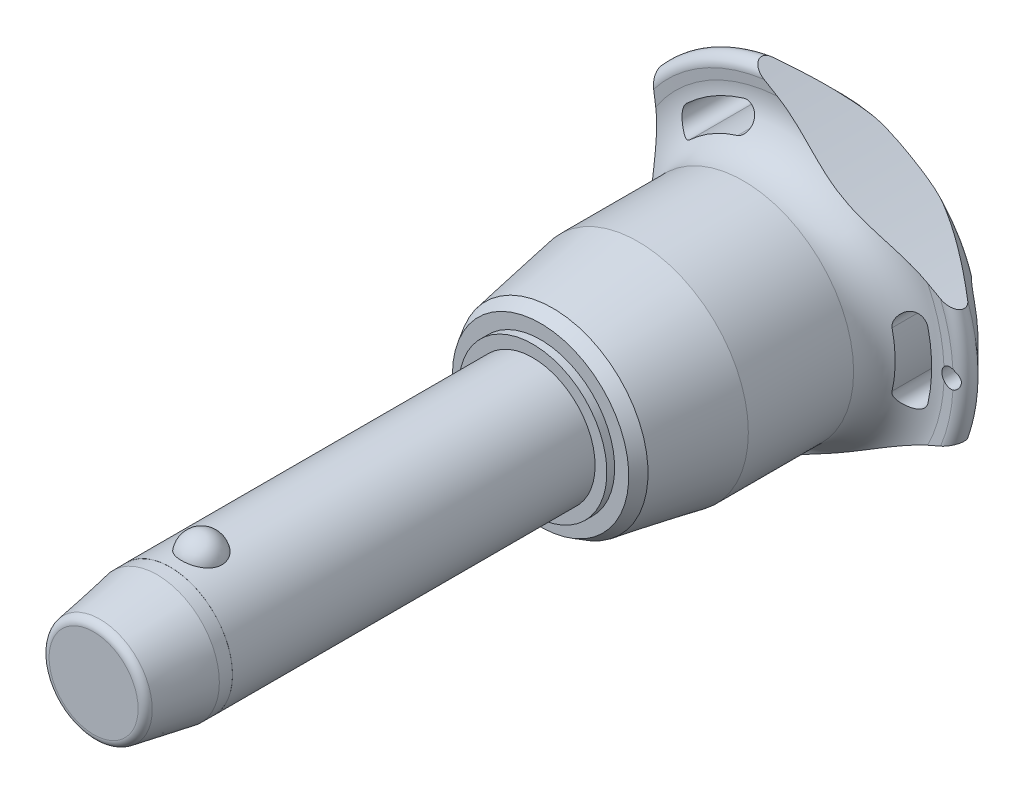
from build123d import *

# Parameters (mm, degrees)
SKETCH1_R           = 10
BOSS_EXTRUDE1_DEPTH = 50
SKETCH2_R           = 8.75
BOSS_EXTRUDE2_DEPTH = 50.7
BOSS_EXTRUDE3_START = 20.5
SKETCH1_2_R         = 10
BOSS_EXTRUDE3_DEPTH = 20.5
CHAMFER1_SIZE       = 10.25
CHAMFER1_SIZE2      = 1.807351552
FILLET1_R           = 1.25
SKETCH6_R           = 176.92625
CUT_EXTRUDE1_DEPTH  = 109.493284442
CIRPATTERN1_COUNT   = 3
SKETCH7_R           = 1.5
CUT_EXTRUDE2_DEPTH  = 109.35288326
SKETCH8_R           = 10
SKETCH8_R_2         = 9.99
CUT_EXTRUDE3_DEPTH  = 12.3


with BuildPart() as part:
    # Sketch1 → Boss-Extrude1 (new body)
    with BuildSketch(Plane.XY):
        Circle(SKETCH1_R)
    extrude(amount=-BOSS_EXTRUDE1_DEPTH)

    # Sketch2 → Boss-Extrude2 (add)
    with BuildSketch(Plane(origin=(0, 0, -50), x_dir=(-1, 0, 0), z_dir=(0, 0, -1))):
        with Locations(Location((0, 0, 0), (0, 0, 180))):
            Circle(SKETCH2_R)
    extrude(amount=BOSS_EXTRUDE2_DEPTH)

    # Sketch3 → Revolve1 (revolve)
    with BuildSketch(Plane(origin=(0, 0, 0), x_dir=(0, 0, -1), z_dir=(1, 0, 0))):
        with BuildLine():
            Line((-3.201562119, 12.5), (-3.201562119, 5.9))
            ThreePointArc((-3.201562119, 5.9), (0.098437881, 9.2), (-3.201562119, 12.5))
        make_face()
        with BuildLine():
            Line((-3.201562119, -5.9), (-3.201562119, -12.5))
            ThreePointArc((-3.201562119, -12.5), (0.098437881, -9.2), (-3.201562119, -5.9))
        make_face()
    revolve(axis=Axis((0, -5.9, 3.201562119), (0, 1, 0)))

    # Sketch1_2 → Boss-Extrude3 (add)
    with BuildSketch(Plane.XY.offset(BOSS_EXTRUDE3_START)):
        Circle(SKETCH1_2_R)
    extrude(amount=-BOSS_EXTRUDE3_DEPTH)

    # Chamfer1
    chamfer1_edges = [part.edges().sort_by_distance(p)[0] for p in [
        (-10, 0, 20.5),
    ]]
    chamfer1_side = [part.faces().sort_by_distance(p)[0] for p in [
        (-10, 0, -14.75),
    ]]
    chamfer(chamfer1_edges, length=CHAMFER1_SIZE, length2=CHAMFER1_SIZE2, reference=chamfer1_side[0])

    # Fillet1
    fillet1_edges = [part.edges().sort_by_distance(p)[0] for p in [
        (-8.192648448, 0, 20.5),
        (-8.75, 0, -100.7),
    ]]
    fillet(fillet1_edges, radius=FILLET1_R)

    # Sketch4 → Revolve2 (revolve)
    with BuildSketch(Plane(origin=(0, 0, 0), x_dir=(0, 0, -1), z_dir=(1, 0, 0)), mode=Mode.PRIVATE) as revolve2_sk:
        Polygon((50, 0), (50, 11.888848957), (51.25, 11.888848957), (51.25, 14.153854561), (53.211552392, 15.286357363), (66.9, 17.7), (83.8, 17.7), (83.8, 0), align=None)
    revolve(revolve2_sk.sketch.rotate(Axis((0, 0, -83.8), (0, 0, 1)), 90), axis=Axis((0, 0, -83.8), (0, 0, 1)))

    # Sketch5 → Revolve3 (revolve)
    with BuildSketch(Plane(origin=(0, 0, 0), x_dir=(0, 0, -1), z_dir=(1, 0, 0)), mode=Mode.PRIVATE) as revolve3_sk:
        with BuildLine():
            Line((90.778589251, 25.247075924), (90.654893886, 26.824954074))
            ThreePointArc((90.654893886, 26.824954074), (91.580366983, 28.40313166), (93.38137085, 28.08137085))
            Line((93.38137085, 28.08137085), (99.763226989, 21.69951471))
            ThreePointArc((99.763226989, 21.69951471), (100.7, 19.381044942), (99.683055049, 17.096604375))
            ThreePointArc((99.683055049, 17.096604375), (94.18864484, 9.321268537), (92.25, 0))
            Line((92.25, 0), (83.8, 0))
            Line((83.8, 0), (83.8, 17.7))
            ThreePointArc((83.8, 17.7), (88.939529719, 19.947607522), (90.778589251, 25.247075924))
        make_face()
    revolve(revolve3_sk.sketch.rotate(Axis((0, 0, -92.25), (0, 0, 1)), 90), axis=Axis((0, 0, -92.25), (0, 0, 1)))

    # Sketch6 → Cut-Extrude1 (cut, through all)
    with BuildSketch(Plane.XY):
        with Locations((-197.42625, 0)):
            Circle(SKETCH6_R)
        with BuildLine():
            ThreePointArc((22.762066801, -5.252833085), (23.360306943, 0), (22.762066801, 5.252833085))
            ThreePointArc((22.762066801, 5.252833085), (20.499354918, 6.667021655), (19.085166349, 4.404309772))
            ThreePointArc((19.085166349, 4.404309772), (19.586768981, 0), (19.085166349, -4.404309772))
            ThreePointArc((19.085166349, -4.404309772), (20.499354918, -6.667021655), (22.762066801, -5.252833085))
        make_face()
    cut_extrude1 = extrude(amount=-CUT_EXTRUDE1_DEPTH, mode=Mode.SUBTRACT)

    # CirPattern1: Cut-Extrude1 ×3 about axis
    cirpattern1_axis = Axis((0, 0, 0), (0, 0, 1))
    for i in range(1, CIRPATTERN1_COUNT):
        add(cut_extrude1.rotate(cirpattern1_axis, i * 360 / CIRPATTERN1_COUNT), mode=Mode.SUBTRACT)

    # Sketch7 → Cut-Extrude2 (cut, through all)
    with BuildSketch(Plane.XY):
        with Locations(Location((26.360306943, 0, 0), (0, 0, 286.501656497))):
            Circle(SKETCH7_R)
    extrude(amount=-CUT_EXTRUDE2_DEPTH, mode=Mode.SUBTRACT)

    # Sketch8 → Cut-Extrude3 (cut)
    with BuildSketch(Plane.XY.offset(20.5)):
        Circle(SKETCH8_R)
        Circle(SKETCH8_R_2, mode=Mode.SUBTRACT)
    extrude(amount=-CUT_EXTRUDE3_DEPTH, mode=Mode.SUBTRACT)


solid = part.part
